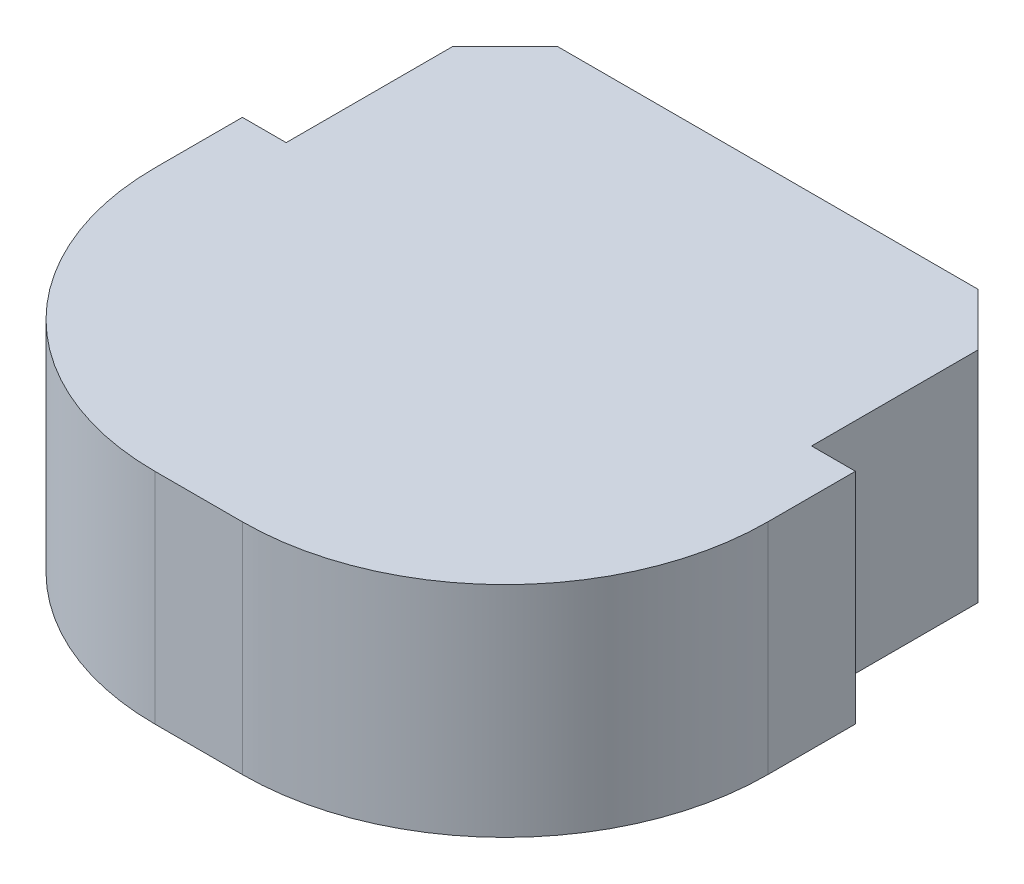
from build123d import *

# Parameters (mm, degrees)
SKETCH1_W           = 8.89
SKETCH1_H           = 5.08
BOSS_EXTRUDE1_DEPTH = 3.175
SKETCH2_W           = 7.62
SKETCH2_H           = 3.175
BOSS_EXTRUDE2_DEPTH = 3.175
CHAMFER1_SIZE       = 0.762
FILLET1_R           = 3.81


with BuildPart() as part:
    # Sketch1 → Boss-Extrude1 (new body)
    with BuildSketch(Plane(origin=(0, 0, 0), x_dir=(1, 0, 0), z_dir=(0, 1, 0))):
        Rectangle(SKETCH1_W, SKETCH1_H)
    extrude(amount=BOSS_EXTRUDE1_DEPTH)

    # Sketch2 → Boss-Extrude2 (add)
    with BuildSketch(Plane(origin=(0, 0, -2.54), x_dir=(-1, 0, 0), z_dir=(0, 0, -1))):
        with Locations((0, 1.5875)):
            Rectangle(SKETCH2_W, SKETCH2_H)
    extrude(amount=BOSS_EXTRUDE2_DEPTH)

    # Chamfer1
    chamfer1_edges = [part.edges().sort_by_distance(p)[0] for p in [
        (-3.81, 1.5875, -5.715),
        (3.81, 1.5875, -5.715),
    ]]
    chamfer(chamfer1_edges, length=CHAMFER1_SIZE)

    # Fillet1
    fillet1_edges = [part.edges().sort_by_distance(p)[0] for p in [
        (4.445, 1.5875, 2.54),
        (-4.445, 1.5875, 2.54),
    ]]
    fillet(fillet1_edges, radius=FILLET1_R)


solid = part.part
